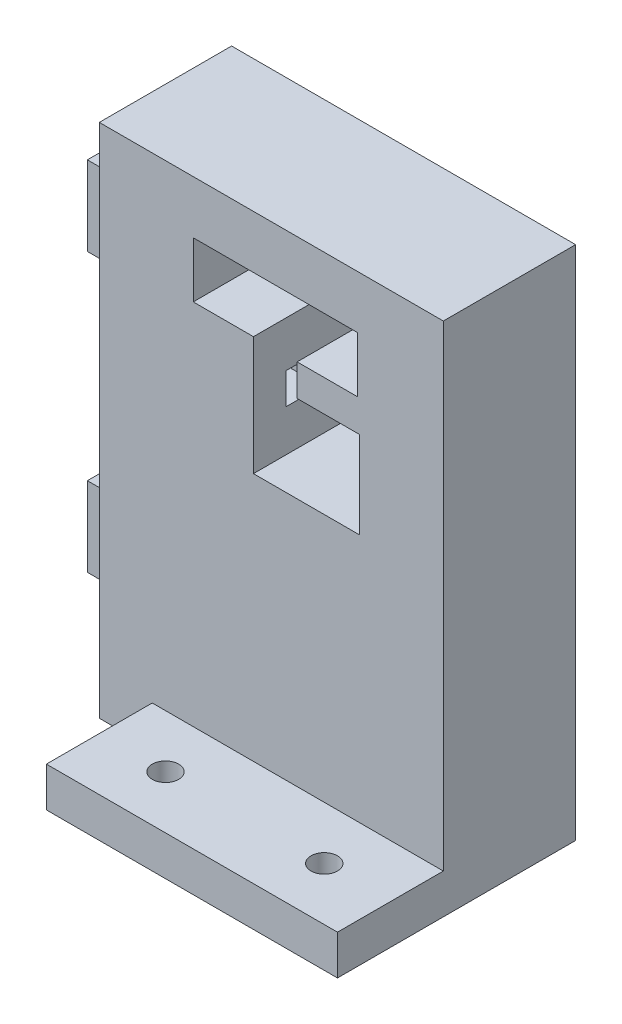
from build123d import *

# Parameters (mm, degrees)
SKETCH1_W                = 50
SKETCH1_H                = 150
BOSS_EXTRUDE1_DEPTH      = 250
SKETCH2_R                = 52.5
CUT_EXTRUDE1_DEPTH       = 15
BOSS_EXTRUDE2_DEPTH      = 150
BOSS_EXTRUDE3_DEPTH      = 175
SKETCH10_W               = 49.988184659
SKETCH10_H               = 250
BOSS_EXTRUDE4_DEPTH      = 200
CUT_EXTRUDE4_DEPTH       = 471.132959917
SKETCH12_W               = 200
SKETCH12_H               = 49.988184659
CUT_EXTRUDE5_DEPTH       = 55
CUT_EXTRUDE8_DEPTH       = 20
SKETCH17_W               = 12.5
SKETCH17_H               = 10.5
CUT_EXTRUDE9_DEPTH       = 9
SKETCH20_R               = 54.5
CUT_EXTRUDE10_DEPTH      = 10
SKETCH21_W               = 182.056865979
SKETCH21_H               = 55
CUT_EXTRUDE11_DEPTH      = 457.207189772
SKETCH24_W               = 16.5
SKETCH24_H               = 16.5
CUT_EXTRUDE13_DEPTH      = 50
SKETCH25_W               = 16.5
SKETCH25_H               = 22
CUT_EXTRUDE14_DEPTH      = 50
SKETCH26_W               = 16.5
SKETCH26_H               = 6.313729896
CUT_EXTRUDE15_DEPTH      = 50
CUT_EXTRUDE16_START      = -71.75
CUT_EXTRUDE16_DEPTH      = 29
SKETCH29_W               = 13.5
SKETCH29_H               = 11.8
CUT_EXTRUDE18_DEPTH      = 13.5
SKETCH30_W               = 40
SKETCH30_H               = 32.854304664
CUT_EXTRUDE19_DEPTH      = 50
SKETCH31_R               = 3.5
CUT_EXTRUDE20_DEPTH      = 20
CUT_EXTRUDE21_DEPTH      = 33
SKETCH33_R               = 63
SKETCH33_R_2             = 60
CUT_EXTRUDE22_DEPTH      = 20
CUT_EXTRUDE24_DEPTH      = 444.339599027
CUT_EXTRUDE24_DEPTH_BACK = 444.339599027
SKETCH34_W               = 192.037708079
SKETCH34_H               = 235
CUT_EXTRUDE25_DEPTH      = 444.339599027
CUT_EXTRUDE25_DEPTH_BACK = 444.339599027
SKETCH35_W               = 71
SKETCH35_H               = 90
SKETCH35_W_2             = 71.037708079
SKETCH35_H_2             = 40.011815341
BOSS_EXTRUDE5_START      = -155
SKETCH36_W               = 50
SKETCH36_H               = 40.011815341
BOSS_EXTRUDE5_DEPTH      = 40
SKETCH37_W               = 110
SKETCH37_H               = 15
BOSS_EXTRUDE6_DEPTH      = 40
CUT_EXTRUDE26_DEPTH      = 437.949653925
CUT_EXTRUDE26_DEPTH_BACK = 437.949653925
SKETCH38_R               = 5
SKETCH39_W               = 20
SKETCH39_H               = 20
BOSS_EXTRUDE7_DEPTH      = 30
CUT_EXTRUDE29_DEPTH      = 310.558805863
CUT_EXTRUDE29_DEPTH_BACK = 310.558805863
SKETCH40_W               = 120
SKETCH40_H               = 195
SKETCH41_W               = 19
SKETCH41_H               = 30
BOSS_EXTRUDE8_DEPTH      = 20


with BuildPart() as part:
    # Sketch1 → Boss-Extrude1 (new body)
    with BuildSketch(Plane(origin=(0, 0, 0), x_dir=(1, 0, 0), z_dir=(0, 1, 0))):
        with Locations((5, 75)):
            Rectangle(SKETCH1_W, SKETCH1_H)
    extrude(amount=BOSS_EXTRUDE1_DEPTH)

    # Sketch2 → Cut-Extrude1 (cut)
    with BuildSketch(Plane(origin=(30, 0, 0), x_dir=(0, 0, -1), z_dir=(1, 0, 0))):
        with Locations((75, 175)):
            Circle(SKETCH2_R)
    extrude(amount=-CUT_EXTRUDE1_DEPTH, mode=Mode.SUBTRACT)

    # Sketch4 → Boss-Extrude2 (add)
    with BuildSketch(Plane.XY):
        with BuildLine():
            Line((30, 0), (30, 62.5))
            ThreePointArc((30, 62.5), (53.728602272, 17.849160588), (101.037708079, 0))
            Line((101.037708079, 0), (30, 0))
        make_face()
        with BuildLine():
            Line((-20, 0), (-91, 0))
            ThreePointArc((-91, 0), (-43.705047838, 17.850934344), (-20, 62.5))
            Line((-20, 62.5), (-20, 0))
        make_face()
    extrude(amount=-BOSS_EXTRUDE2_DEPTH)

    # Sketch8 → Boss-Extrude3 (add)
    with BuildSketch(Plane(origin=(0, 0, -150), x_dir=(-1, 0, 0), z_dir=(0, 0, -1))):
        with BuildLine():
            Line((-30, 250), (-30, 62.5))
            ThreePointArc((-30, 62.5), (-53.728602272, 17.849160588), (-101.037708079, 0))
            Line((-101.037708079, 0), (91, 0))
            ThreePointArc((91, 0), (43.705047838, 17.850934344), (20, 62.5))
            Line((20, 62.5), (20, 250))
            Line((20, 250), (-30, 250))
        make_face()
    extrude(amount=BOSS_EXTRUDE3_DEPTH)

    # Sketch10 → Boss-Extrude4 (add)
    with BuildSketch(Plane(origin=(30, 0, 0), x_dir=(0, 0, -1), z_dir=(1, 0, 0))):
        with Locations((300.005907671, 125)):
            Rectangle(SKETCH10_W, SKETCH10_H)
    extrude(amount=BOSS_EXTRUDE4_DEPTH)

    # Sketch11 → Cut-Extrude4 (cut, through all)
    with BuildSketch(Plane(origin=(0, 0, -325), x_dir=(-1, 0, 0), z_dir=(0, 0, -1))):
        Polygon((-166.5, 175), (-135.5, 175), (-135.5, 154), (-197.5, 154), (-197.5, 175), align=None)
    extrude(amount=-CUT_EXTRUDE4_DEPTH, mode=Mode.SUBTRACT)

    # Sketch12 → Cut-Extrude5 (cut)
    with BuildSketch(Plane(origin=(0, 250, 0), x_dir=(1, 0, 0), z_dir=(0, 1, 0))):
        with Locations((130, 300.005907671)):
            Rectangle(SKETCH12_W, SKETCH12_H)
    extrude(amount=-CUT_EXTRUDE5_DEPTH, mode=Mode.SUBTRACT)

    # Sketch16 → Cut-Extrude8 (cut)
    with BuildSketch(Plane(origin=(15, 0, 0), x_dir=(0, 0, -1), z_dir=(1, 0, 0))):
        with BuildLine():
            Line((71.75, 180), (78.25, 180))
            add(Edge.make_bspline(
                [(78.25, 170), (84.285140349, 175), (78.25, 180)],
                knots=[0, 0, 0, 1, 1, 1], degree=2))
            Line((78.25, 170), (71.75, 170))
            add(Edge.make_bspline(
                [(71.75, 180), (66.057994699, 175), (71.75, 170)],
                knots=[0, 0, 0, 1, 1, 1], degree=2))
        make_face()
    extrude(amount=-CUT_EXTRUDE8_DEPTH, mode=Mode.SUBTRACT)

    # Sketch17 → Cut-Extrude9 (cut)
    with BuildSketch(Plane(origin=(15, 0, 0), x_dir=(0, 0, -1), z_dir=(1, 0, 0))):
        with Locations((75.068297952, 175)):
            Rectangle(SKETCH17_W, SKETCH17_H)
    extrude(amount=-CUT_EXTRUDE9_DEPTH, mode=Mode.SUBTRACT)

    # Sketch20 → Cut-Extrude10 (cut)
    with BuildSketch(Plane(origin=(30, 0, 0), x_dir=(0, 0, -1), z_dir=(1, 0, 0))):
        with Locations((75, 175)):
            Circle(SKETCH20_R)
    extrude(amount=-CUT_EXTRUDE10_DEPTH, mode=Mode.SUBTRACT)

    # Sketch21 → Cut-Extrude11 (cut, through all)
    with BuildSketch(Plane(origin=(30, 0, 0), x_dir=(0, 0, -1), z_dir=(1, 0, 0))):
        with Locations((233.97156701, 222.5)):
            Rectangle(SKETCH21_W, SKETCH21_H)
    extrude(amount=-CUT_EXTRUDE11_DEPTH, mode=Mode.SUBTRACT)

    # Sketch24 → Cut-Extrude13 (cut)
    with BuildSketch(Plane.XY.offset(-275.011815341)):
        with Locations((166.5, 145.75)):
            Rectangle(SKETCH24_W, SKETCH24_H)
    extrude(amount=-CUT_EXTRUDE13_DEPTH, mode=Mode.SUBTRACT)

    # Sketch25 → Cut-Extrude14 (cut)
    with BuildSketch(Plane.XY.offset(-275.011815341)):
        with Locations((166.5, 120.186270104)):
            Rectangle(SKETCH25_W, SKETCH25_H)
    extrude(amount=-CUT_EXTRUDE14_DEPTH, mode=Mode.SUBTRACT)

    # Sketch26 → Cut-Extrude15 (cut)
    with BuildSketch(Plane.XY.offset(-275.011815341)):
        with Locations((166.5, 134.343135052)):
            Rectangle(SKETCH26_W, SKETCH26_H)
    extrude(amount=-CUT_EXTRUDE15_DEPTH, mode=Mode.SUBTRACT)

    # Sketch27 → Cut-Extrude16 (cut)
    with BuildSketch(Plane(origin=(230, 0, 0), x_dir=(0, 0, -1), z_dir=(1, 0, 0)).offset(CUT_EXTRUDE16_START)):
        with BuildLine():
            Line((298.751152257, 135.600374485), (291.251152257, 135.600374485))
            add(Edge.make_bspline(
                [(291.251152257, 135.600374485), (285.706075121, 129.957776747), (291.251152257, 125.100374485)],
                knots=[0, 0, 0, 1, 1, 1], degree=2))
            Line((291.251152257, 125.100374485), (298.751152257, 125.100374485))
            add(Edge.make_bspline(
                [(298.751152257, 135.600374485), (304.296229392, 129.957776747), (298.751152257, 125.100374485)],
                knots=[0, 0, 0, 1, 1, 1], degree=2))
        make_face()
    extrude(amount=-CUT_EXTRUDE16_DEPTH, mode=Mode.SUBTRACT)

    # Sketch29 → Cut-Extrude18 (cut)
    with BuildSketch(Plane(origin=(158.25, 0, 0), x_dir=(0, 0, -1), z_dir=(1, 0, 0))):
        with Locations((294.070111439, 130.82325265)):
            Rectangle(SKETCH29_W, SKETCH29_H)
        with BuildLine():
            Line((298.001152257, 135.600374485), (291.501152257, 135.600374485))
            add(Edge.make_bspline(
                [(291.501152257, 135.600374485), (285.456075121, 129.957776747), (291.501152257, 125.100374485)],
                knots=[0, 0, 0, 1, 1, 1], degree=2))
            Line((291.501152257, 125.100374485), (298.001152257, 125.100374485))
            add(Edge.make_bspline(
                [(298.001152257, 125.100374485), (303.344461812, 129.957776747), (298.001152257, 135.600374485)],
                knots=[0, 0, 0, 1, 1, 1], degree=2))
        make_face(mode=Mode.SUBTRACT)
    extrude(amount=-CUT_EXTRUDE18_DEPTH, mode=Mode.SUBTRACT)

    # Sketch30 → Cut-Extrude19 (cut)
    with BuildSketch(Plane.XY.offset(-275.011815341)):
        with Locations((178.25, 125.602490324)):
            Rectangle(SKETCH30_W, SKETCH30_H)
    extrude(amount=-CUT_EXTRUDE19_DEPTH, mode=Mode.SUBTRACT)

    # Sketch31 → Cut-Extrude20 (cut)
    with BuildSketch(Plane(origin=(-5, 0, 0), x_dir=(0, 0, -1), z_dir=(1, 0, 0))):
        with Locations((74.950457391, 175.071160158)):
            Circle(SKETCH31_R)
    extrude(amount=-CUT_EXTRUDE20_DEPTH, mode=Mode.SUBTRACT)

    # Sketch32 → Cut-Extrude21 (cut)
    with BuildSketch(Plane(origin=(0, 0, -325), x_dir=(-1, 0, 0), z_dir=(0, 0, -1))):
        with BuildLine():
            ThreePointArc((-128.116356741, 129.990231), (-128.41227742, 131.398732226), (-129.25, 132.569059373))
            Line((-129.25, 132.569059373), (-129.25, 127.411402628))
            ThreePointArc((-129.25, 127.411402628), (-128.41227742, 128.581729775), (-128.116356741, 129.990231))
        make_face()
        with BuildLine():
            Line((-129.25, 127.411402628), (-129.25, 132.569059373))
            ThreePointArc((-129.25, 132.569059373), (-135.116356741, 129.990231), (-129.25, 127.411402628))
        make_face()
    extrude(amount=-CUT_EXTRUDE21_DEPTH, mode=Mode.SUBTRACT)

    # Sketch33 → Cut-Extrude22 (cut)
    with BuildSketch(Plane(origin=(30, 0, 0), x_dir=(0, 0, -1), z_dir=(1, 0, 0))):
        with Locations((74.950457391, 175.071160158)):
            Circle(SKETCH33_R)
        with Locations((74.950457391, 175.071160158)):
            Circle(SKETCH33_R_2, mode=Mode.SUBTRACT)
    extrude(amount=-CUT_EXTRUDE22_DEPTH, mode=Mode.SUBTRACT)

    # Sketch34 → Cut-Extrude24 (cut, two sides: drawn at the far end of the back side and taken through both)
    with BuildSketch(Plane(origin=(0, 195, 0), x_dir=(1, 0, 0), z_dir=(0, 1, 0)).offset(-CUT_EXTRUDE24_DEPTH_BACK)):
        with Locations((5.01885404, 117.5)):
            Rectangle(SKETCH34_W, SKETCH34_H)
    extrude(amount=CUT_EXTRUDE24_DEPTH + CUT_EXTRUDE24_DEPTH_BACK, mode=Mode.SUBTRACT)

    # Sketch35 → Cut-Extrude25 (cut, two sides: drawn at the far end of the back side and taken through both)
    with BuildSketch(Plane(origin=(0, 195, 0), x_dir=(1, 0, 0), z_dir=(0, 1, 0)).offset(-CUT_EXTRUDE25_DEPTH_BACK)):
        with Locations((-55.5, 280)):
            Rectangle(SKETCH35_W, SKETCH35_H)
        with Locations((65.51885404, 255.005907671)):
            Rectangle(SKETCH35_W_2, SKETCH35_H_2)
    extrude(amount=CUT_EXTRUDE25_DEPTH + CUT_EXTRUDE25_DEPTH_BACK, mode=Mode.SUBTRACT)

    # Sketch36 → Boss-Extrude5 (add)
    with BuildSketch(Plane(origin=(0, 195, 0), x_dir=(1, 0, 0), z_dir=(0, 1, 0)).offset(BOSS_EXTRUDE5_START)):
        with Locations((55, 255.005907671)):
            Rectangle(SKETCH36_W, SKETCH36_H)
    extrude(amount=-BOSS_EXTRUDE5_DEPTH)

    # Sketch37 → Boss-Extrude6 (add)
    with BuildSketch(Plane.XY.offset(-275.011815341)):
        with Locations((175, 7.5)):
            Rectangle(SKETCH37_W, SKETCH37_H)
    extrude(amount=BOSS_EXTRUDE6_DEPTH)

    # Sketch38 → Cut-Extrude26 (cut, two sides: drawn at the far end of the back side and taken through both)
    with BuildSketch(Plane(origin=(0, 15, 0), x_dir=(1, 0, 0), z_dir=(0, 1, 0)).offset(-CUT_EXTRUDE26_DEPTH_BACK)):
        with Locations(Location((145, 255.011815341, 0), (0, 0, 180))):
            Circle(SKETCH38_R)
        with Locations(Location((205, 255.011815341, 0), (0, 0, 180))):
            Circle(SKETCH38_R)
    extrude(amount=CUT_EXTRUDE26_DEPTH + CUT_EXTRUDE26_DEPTH_BACK, mode=Mode.SUBTRACT)

    # Sketch39 → Boss-Extrude7 (add)
    with BuildSketch(Plane.XY.offset(-235)):
        with Locations((5, 152)):
            Rectangle(SKETCH39_W, SKETCH39_H)
        with Locations((5, 99)):
            Rectangle(SKETCH39_W, SKETCH39_H)
        with Locations((5, 46)):
            Rectangle(SKETCH39_W, SKETCH39_H)
        with Locations((52, 20)):
            Rectangle(SKETCH39_W, SKETCH39_H)
    extrude(amount=BOSS_EXTRUDE7_DEPTH)

    # Sketch40 → Cut-Extrude29 (cut, two sides: drawn at the far end of the back side and taken through both)
    with BuildSketch(Plane.XY.offset(-275.011815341).offset(-CUT_EXTRUDE29_DEPTH_BACK)):
        with Locations((40, 97.5)):
            Rectangle(SKETCH40_W, SKETCH40_H)
    extrude(amount=CUT_EXTRUDE29_DEPTH + CUT_EXTRUDE29_DEPTH_BACK, mode=Mode.SUBTRACT)

    # Sketch41 → Boss-Extrude8 (add)
    with BuildSketch(Plane.ZY.offset(-100)):
        Polygon((-309.50590767, 135), (-290.50590767, 135), (-290.50590767, 165), (-300.00590767, 165), (-309.50590767, 165), align=None)
        with Locations((-300.00590767, 45)):
            Rectangle(SKETCH41_W, SKETCH41_H)
    extrude(amount=BOSS_EXTRUDE8_DEPTH)


solid = part.part
